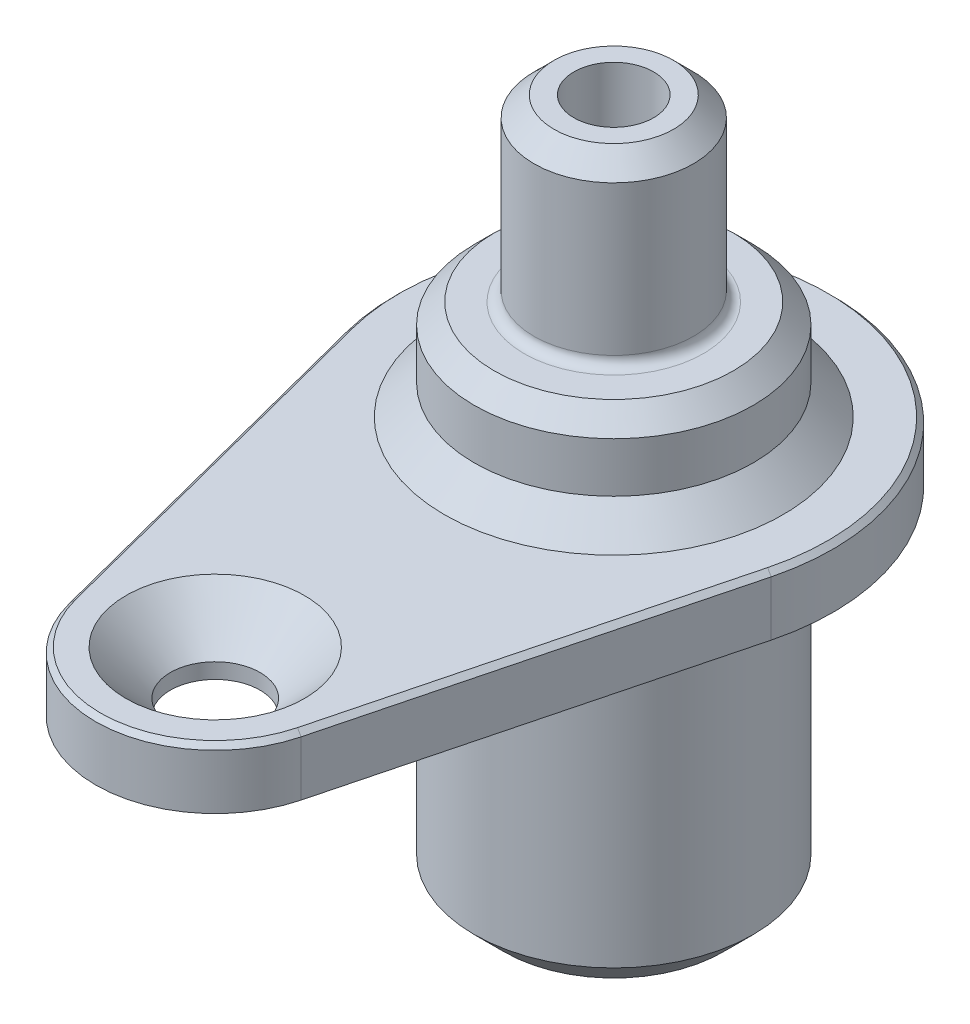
from build123d import *

# Parameters (mm, degrees)
BOSS_EXTRUDE1_DEPTH      = 6
BOSS_EXTRUDE2_DEPTH      = 34
BOSS_EXTRUDE2_DEPTH_BACK = 35
SKETCH4_R                = 14
CHAMFER1_SIZE            = 3
CHAMFER2_SIZE            = 3
CUT_EXTRUDE1_DEPTH       = 67.430414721
CUT_EXTRUDE1_DEPTH_BACK  = 67.430414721
SKETCH5_R                = 4
SKETCH6_R                = 14
SKETCH6_R_2              = 8
CUT_EXTRUDE2_DEPTH       = 18
CHAMFER3_SIZE            = 2
CHAMFER4_SIZE            = 2
FILLET1_R                = 1
CHAMFER5_SIZE            = 1
CHAMFER6_SIZE            = 0.5


with BuildPart() as part:
    # Sketch1 → Boss-Extrude1 (new body)
    with BuildSketch(Plane(origin=(0, 0, 0), x_dir=(1, 0, 0), z_dir=(0, 1, 0))):
        with BuildLine():
            Line((21.301408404, -5.5), (11.618950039, -43))
            ThreePointArc((11.618950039, -43), (0, -52), (-11.618950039, -43))
            Line((-11.618950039, -43), (-21.301408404, -5.5))
            ThreePointArc((-21.301408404, -5.5), (0, 22), (21.301408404, -5.5))
        make_face()
    extrude(amount=BOSS_EXTRUDE1_DEPTH)

    # Sketch3 → CSK for M8 Hex Socket Countersunk Cap Sc (revolve, cut)
    with BuildSketch(Plane(origin=(0, 6, 40), x_dir=(0, 0, 1), z_dir=(1, 0, 0))):
        Polygon((0, 0), (0, 6), (4.5, 6), (4.5, 4.46), (8.96, 0), align=None)
    revolve(axis=Axis((0, 12.35, 40), (0, -1, 0)), mode=Mode.SUBTRACT)

    # Sketch4 → Boss-Extrude2 (add, two sides: drawn at the far end of the back side and taken through both)
    with BuildSketch(Plane(origin=(0, 0, 0), x_dir=(1, 0, 0), z_dir=(0, 1, 0)).offset(-BOSS_EXTRUDE2_DEPTH_BACK)):
        with Locations(Location((0, 0, 0), (0, 0, 270))):
            Circle(SKETCH4_R)
    extrude(amount=BOSS_EXTRUDE2_DEPTH + BOSS_EXTRUDE2_DEPTH_BACK)

    # Chamfer1
    chamfer1_edges = [part.edges().sort_by_distance(p)[0] for p in [
        (0, 6, -14),
    ]]
    chamfer(chamfer1_edges, length=CHAMFER1_SIZE)

    # Chamfer2
    chamfer2_edges = [part.edges().sort_by_distance(p)[0] for p in [
        (0, -35, -14),
    ]]
    chamfer(chamfer2_edges, length=CHAMFER2_SIZE)

    # Sketch5 → Cut-Extrude1 (cut, two sides: drawn at the far end of the back side and taken through both)
    with BuildSketch(Plane(origin=(0, 0, 0), x_dir=(1, 0, 0), z_dir=(0, 1, 0)).offset(-CUT_EXTRUDE1_DEPTH_BACK)):
        with Locations(Location((0, 0, 0), (0, 0, 270))):
            Circle(SKETCH5_R)
    extrude(amount=CUT_EXTRUDE1_DEPTH + CUT_EXTRUDE1_DEPTH_BACK, mode=Mode.SUBTRACT)

    # Sketch6 → Cut-Extrude2 (cut)
    with BuildSketch(Plane(origin=(0, 34, 0), x_dir=(1, 0, 0), z_dir=(0, 1, 0))):
        with Locations(Location((0, 0, 0), (0, 0, 270))):
            Circle(SKETCH6_R)
        with Locations(Location((0, 0, 0), (0, 0, 270))):
            Circle(SKETCH6_R_2, mode=Mode.SUBTRACT)
    extrude(amount=-CUT_EXTRUDE2_DEPTH, mode=Mode.SUBTRACT)

    # Chamfer3
    chamfer3_edges = [part.edges().sort_by_distance(p)[0] for p in [
        (0, 16, -14),
    ]]
    chamfer(chamfer3_edges, length=CHAMFER3_SIZE)

    # Chamfer4
    chamfer4_edges = [part.edges().sort_by_distance(p)[0] for p in [
        (0, 34, -8),
    ]]
    chamfer(chamfer4_edges, length=CHAMFER4_SIZE)

    # Fillet1
    fillet1_edges = [part.edges().sort_by_distance(p)[0] for p in [
        (0, 16, -8),
    ]]
    fillet(fillet1_edges, radius=FILLET1_R)

    # Chamfer5
    chamfer5_edges = [part.edges().sort_by_distance(p)[0] for p in [
        (0, 0, -14),
    ]]
    chamfer(chamfer5_edges, length=CHAMFER5_SIZE)

    # Chamfer6
    chamfer6_edges = [part.edges().sort_by_distance(p)[0] for p in [
        (0, 6, -22),
        (-16.460179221, 6, 24.25),
        (0, 6, 52),
        (16.460179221, 6, 24.25),
    ]]
    chamfer(chamfer6_edges, length=CHAMFER6_SIZE)


solid = part.part
